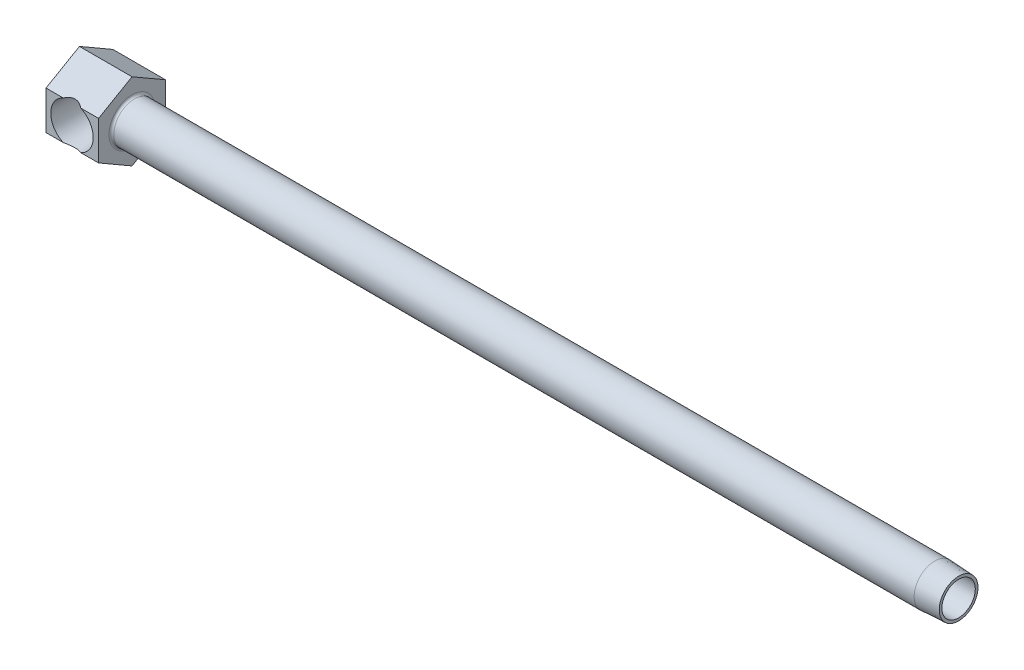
ISO-10303-21;
HEADER;
FILE_DESCRIPTION(('STEP AP214'),'2;1');
FILE_NAME('part.step','',(''),(''),'','','');
FILE_SCHEMA(('AUTOMOTIVE_DESIGN { 1 0 10303 214 1 1 1 1 }'));
ENDSEC;
DATA;
#1=APPLICATION_CONTEXT('core data for automotive mechanical design processes');
#2=APPLICATION_PROTOCOL_DEFINITION('international standard','automotive_design',2000,#1);
#3=PRODUCT_CONTEXT('',#1,'mechanical');
#4=PRODUCT('Part','Part','',(#3));
#5=PRODUCT_RELATED_PRODUCT_CATEGORY('part','',(#4));
#6=PRODUCT_DEFINITION_FORMATION('','',#4);
#7=PRODUCT_DEFINITION_CONTEXT('part definition',#1,'design');
#8=PRODUCT_DEFINITION('design','',#6,#7);
#9=PRODUCT_DEFINITION_SHAPE('','',#8);
#10=(LENGTH_UNIT() NAMED_UNIT(*) SI_UNIT(.MILLI.,.METRE.));
#11=(NAMED_UNIT(*) PLANE_ANGLE_UNIT() SI_UNIT($,.RADIAN.));
#12=(NAMED_UNIT(*) SI_UNIT($,.STERADIAN.) SOLID_ANGLE_UNIT());
#13=UNCERTAINTY_MEASURE_WITH_UNIT(LENGTH_MEASURE(1.E-05),#10,'distance_accuracy_value','');
#14=(GEOMETRIC_REPRESENTATION_CONTEXT(3) GLOBAL_UNCERTAINTY_ASSIGNED_CONTEXT((#13)) GLOBAL_UNIT_ASSIGNED_CONTEXT((#10,
#11,#12)) REPRESENTATION_CONTEXT('',''));
#15=CARTESIAN_POINT('',(0.,0.,0.));
#16=DIRECTION('',(0.,0.,1.));
#17=DIRECTION('',(1.,0.,0.));
#18=AXIS2_PLACEMENT_3D('',#15,#16,#17);
#19=CARTESIAN_POINT('',(63.5,0.,11.1125));
#20=DIRECTION('',(-1.,0.,0.));
#21=DIRECTION('',(0.,0.,1.));
#22=AXIS2_PLACEMENT_3D('',#19,#20,#21);
#23=CYLINDRICAL_SURFACE('',#22,6.858);
#24=CARTESIAN_POINT('',(18.2499,0.,11.1125));
#25=DIRECTION('',(-1.,0.,0.));
#26=DIRECTION('',(0.,-1.,0.));
#27=AXIS2_PLACEMENT_3D('',#24,#25,#26);
#28=CIRCLE('',#27,6.858);
#29=CARTESIAN_POINT('',(18.2499,-6.858,11.1125));
#30=VERTEX_POINT('',#29);
#31=EDGE_CURVE('E174',#30,#30,#28,.F.);
#32=ORIENTED_EDGE('',*,*,#31,.T.);
#33=EDGE_LOOP('',(#32));
#34=FACE_BOUND('',#33,.T.);
#35=CARTESIAN_POINT('',(284.1752,0.,11.1125));
#36=DIRECTION('',(1.,0.,0.));
#37=DIRECTION('',(0.,0.,-1.));
#38=AXIS2_PLACEMENT_3D('',#35,#36,#37);
#39=CIRCLE('',#38,6.858);
#40=CARTESIAN_POINT('',(284.1752,0.,4.2545));
#41=VERTEX_POINT('',#40);
#42=EDGE_CURVE('E218',#41,#41,#39,.T.);
#43=ORIENTED_EDGE('',*,*,#42,.F.);
#44=EDGE_LOOP('',(#43));
#45=FACE_BOUND('',#44,.T.);
#46=ADVANCED_FACE('F15',(#34,#45),#23,.T.);
#47=CARTESIAN_POINT('',(17.4625,6.4158048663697,22.225));
#48=DIRECTION('',(0.,0.,-1.));
#49=DIRECTION('',(0.,1.,0.));
#50=AXIS2_PLACEMENT_3D('',#47,#48,#49);
#51=PLANE('',#50);
#52=CARTESIAN_POINT('',(8.636,0.,22.225));
#53=DIRECTION('',(0.,0.,1.));
#54=DIRECTION('',(1.,0.,0.));
#55=AXIS2_PLACEMENT_3D('',#52,#53,#54);
#56=CIRCLE('',#55,7.05231);
#57=CARTESIAN_POINT('',(5.70811266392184,6.4158048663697,22.225));
#58=VERTEX_POINT('',#57);
#59=CARTESIAN_POINT('',(5.70811266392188,-6.41580486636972,22.225));
#60=VERTEX_POINT('',#59);
#61=EDGE_CURVE('E229',#58,#60,#56,.T.);
#62=ORIENTED_EDGE('',*,*,#61,.F.);
#63=DIRECTION('',(-1.,0.,0.));
#64=VECTOR('',#63,1.);
#65=CARTESIAN_POINT('',(17.4625,6.4158048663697,22.225));
#66=LINE('',#65,#64);
#67=CARTESIAN_POINT('',(0.,6.4158048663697,22.225));
#68=VERTEX_POINT('',#67);
#69=EDGE_CURVE('E158',#58,#68,#66,.T.);
#70=ORIENTED_EDGE('',*,*,#69,.T.);
#71=DIRECTION('',(0.,-1.,0.));
#72=VECTOR('',#71,1.);
#73=CARTESIAN_POINT('',(0.,6.4158048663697,22.225));
#74=LINE('',#73,#72);
#75=CARTESIAN_POINT('',(0.,-6.41580486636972,22.225));
#76=VERTEX_POINT('',#75);
#77=EDGE_CURVE('E128',#68,#76,#74,.T.);
#78=ORIENTED_EDGE('',*,*,#77,.T.);
#79=DIRECTION('',(-1.,0.,0.));
#80=VECTOR('',#79,1.);
#81=CARTESIAN_POINT('',(17.4625,-6.41580486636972,22.225));
#82=LINE('',#81,#80);
#83=EDGE_CURVE('E154',#60,#76,#82,.T.);
#84=ORIENTED_EDGE('',*,*,#83,.F.);
#85=EDGE_LOOP('',(#62,#70,#78,#84));
#86=FACE_BOUND('',#85,.T.);
#87=ADVANCED_FACE('F205',(#86),#51,.F.);
#88=CARTESIAN_POINT('',(11.5638873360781,-6.41580486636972,22.225));
#89=VERTEX_POINT('',#88);
#90=CARTESIAN_POINT('',(11.5638873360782,6.4158048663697,22.225));
#91=VERTEX_POINT('',#90);
#92=EDGE_CURVE('E228',#89,#91,#56,.T.);
#93=ORIENTED_EDGE('',*,*,#92,.F.);
#94=CARTESIAN_POINT('',(17.4625,-6.41580486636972,22.225));
#95=VERTEX_POINT('',#94);
#96=EDGE_CURVE('E155',#95,#89,#82,.T.);
#97=ORIENTED_EDGE('',*,*,#96,.F.);
#98=DIRECTION('',(0.,-1.,0.));
#99=VECTOR('',#98,1.);
#100=CARTESIAN_POINT('',(17.4625,6.4158048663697,22.225));
#101=LINE('',#100,#99);
#102=CARTESIAN_POINT('',(17.4625,6.4158048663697,22.225));
#103=VERTEX_POINT('',#102);
#104=EDGE_CURVE('E145',#103,#95,#101,.T.);
#105=ORIENTED_EDGE('',*,*,#104,.F.);
#106=EDGE_CURVE('E159',#103,#91,#66,.T.);
#107=ORIENTED_EDGE('',*,*,#106,.T.);
#108=EDGE_LOOP('',(#93,#97,#105,#107));
#109=FACE_BOUND('',#108,.T.);
#110=ADVANCED_FACE('F211',(#109),#51,.F.);
#111=CARTESIAN_POINT('',(17.4625,12.8316097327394,11.1125));
#112=DIRECTION('',(0.,-0.866025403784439,-0.5));
#113=DIRECTION('',(0.,0.5,-0.866025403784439));
#114=AXIS2_PLACEMENT_3D('',#111,#112,#113);
#115=PLANE('',#114);
#116=ORIENTED_EDGE('',*,*,#69,.F.);
#117=CARTESIAN_POINT('',(8.636,-0.384020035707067,34.002642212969));
#118=DIRECTION('',(0.,-0.866025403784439,-0.5));
#119=DIRECTION('',(0.,-0.5,0.866025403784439));
#120=AXIS2_PLACEMENT_3D('',#117,#118,#119);
#121=ELLIPSE('',#120,14.8098967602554,7.39498405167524);
#122=EDGE_CURVE('E109',#58,#91,#121,.T.);
#123=ORIENTED_EDGE('',*,*,#122,.T.);
#124=ORIENTED_EDGE('',*,*,#106,.F.);
#125=DIRECTION('',(0.,-0.5,0.866025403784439));
#126=VECTOR('',#125,1.);
#127=CARTESIAN_POINT('',(17.4625,12.8316097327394,11.1125));
#128=LINE('',#127,#126);
#129=CARTESIAN_POINT('',(17.4625,12.8316097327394,11.1125));
#130=VERTEX_POINT('',#129);
#131=EDGE_CURVE('E143',#130,#103,#128,.T.);
#132=ORIENTED_EDGE('',*,*,#131,.F.);
#133=DIRECTION('',(-1.,0.,0.));
#134=VECTOR('',#133,1.);
#135=CARTESIAN_POINT('',(17.4625,12.8316097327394,11.1125));
#136=LINE('',#135,#134);
#137=CARTESIAN_POINT('',(0.,12.8316097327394,11.1125));
#138=VERTEX_POINT('',#137);
#139=EDGE_CURVE('E162',#130,#138,#136,.T.);
#140=ORIENTED_EDGE('',*,*,#139,.T.);
#141=DIRECTION('',(0.,-0.5,0.866025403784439));
#142=VECTOR('',#141,1.);
#143=CARTESIAN_POINT('',(0.,12.8316097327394,11.1125));
#144=LINE('',#143,#142);
#145=EDGE_CURVE('E124',#138,#68,#144,.T.);
#146=ORIENTED_EDGE('',*,*,#145,.T.);
#147=EDGE_LOOP('',(#116,#123,#124,#132,#140,#146));
#148=FACE_BOUND('',#147,.T.);
#149=ADVANCED_FACE('F257',(#148),#115,.F.);
#150=CARTESIAN_POINT('',(17.4625,-6.41580486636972,22.225));
#151=DIRECTION('',(0.,0.866025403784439,-0.5));
#152=DIRECTION('',(0.,0.5,0.866025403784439));
#153=AXIS2_PLACEMENT_3D('',#150,#151,#152);
#154=PLANE('',#153);
#155=ORIENTED_EDGE('',*,*,#96,.T.);
#156=CARTESIAN_POINT('',(8.636,0.384020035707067,34.0026422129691));
#157=DIRECTION('',(0.,0.866025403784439,-0.5));
#158=DIRECTION('',(0.,0.5,0.866025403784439));
#159=AXIS2_PLACEMENT_3D('',#156,#157,#158);
#160=ELLIPSE('',#159,14.8098967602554,7.39498405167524);
#161=EDGE_CURVE('E34',#89,#60,#160,.T.);
#162=ORIENTED_EDGE('',*,*,#161,.T.);
#163=ORIENTED_EDGE('',*,*,#83,.T.);
#164=DIRECTION('',(0.,-0.5,-0.866025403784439));
#165=VECTOR('',#164,1.);
#166=CARTESIAN_POINT('',(0.,-6.41580486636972,22.225));
#167=LINE('',#166,#165);
#168=CARTESIAN_POINT('',(0.,-12.8316097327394,11.1125));
#169=VERTEX_POINT('',#168);
#170=EDGE_CURVE('E132',#76,#169,#167,.T.);
#171=ORIENTED_EDGE('',*,*,#170,.T.);
#172=DIRECTION('',(-1.,0.,0.));
#173=VECTOR('',#172,1.);
#174=CARTESIAN_POINT('',(17.4625,-12.8316097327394,11.1125));
#175=LINE('',#174,#173);
#176=CARTESIAN_POINT('',(17.4625,-12.8316097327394,11.1125));
#177=VERTEX_POINT('',#176);
#178=EDGE_CURVE('E149',#177,#169,#175,.T.);
#179=ORIENTED_EDGE('',*,*,#178,.F.);
#180=DIRECTION('',(0.,-0.5,-0.866025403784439));
#181=VECTOR('',#180,1.);
#182=CARTESIAN_POINT('',(17.4625,-6.41580486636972,22.225));
#183=LINE('',#182,#181);
#184=EDGE_CURVE('E147',#95,#177,#183,.T.);
#185=ORIENTED_EDGE('',*,*,#184,.F.);
#186=EDGE_LOOP('',(#155,#162,#163,#171,#179,#185));
#187=FACE_BOUND('',#186,.T.);
#188=ADVANCED_FACE('F235',(#187),#154,.F.);
#189=CARTESIAN_POINT('',(17.4625,-12.8316097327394,11.1125));
#190=DIRECTION('',(0.,0.866025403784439,0.5));
#191=DIRECTION('',(0.,-0.5,0.866025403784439));
#192=AXIS2_PLACEMENT_3D('',#189,#190,#191);
#193=PLANE('',#192);
#194=DIRECTION('',(0.,0.5,-0.866025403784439));
#195=VECTOR('',#194,1.);
#196=CARTESIAN_POINT('',(0.,-12.8316097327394,11.1125));
#197=LINE('',#196,#195);
#198=CARTESIAN_POINT('',(0.,-6.41580486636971,0.));
#199=VERTEX_POINT('',#198);
#200=EDGE_CURVE('E117',#169,#199,#197,.T.);
#201=ORIENTED_EDGE('',*,*,#200,.T.);
#202=DIRECTION('',(-1.,0.,0.));
#203=VECTOR('',#202,1.);
#204=CARTESIAN_POINT('',(17.4625,-6.41580486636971,0.));
#205=LINE('',#204,#203);
#206=CARTESIAN_POINT('',(17.4625,-6.41580486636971,0.));
#207=VERTEX_POINT('',#206);
#208=EDGE_CURVE('E168',#207,#199,#205,.T.);
#209=ORIENTED_EDGE('',*,*,#208,.F.);
#210=DIRECTION('',(0.,0.5,-0.866025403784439));
#211=VECTOR('',#210,1.);
#212=CARTESIAN_POINT('',(17.4625,-12.8316097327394,11.1125));
#213=LINE('',#212,#211);
#214=EDGE_CURVE('E135',#177,#207,#213,.T.);
#215=ORIENTED_EDGE('',*,*,#214,.F.);
#216=ORIENTED_EDGE('',*,*,#178,.T.);
#217=EDGE_LOOP('',(#201,#209,#215,#216));
#218=FACE_BOUND('',#217,.T.);
#219=ADVANCED_FACE('F247',(#218),#193,.F.);
#220=CARTESIAN_POINT('',(17.4625,-6.41580486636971,0.));
#221=DIRECTION('',(0.,0.,1.));
#222=DIRECTION('',(1.,0.,0.));
#223=AXIS2_PLACEMENT_3D('',#220,#221,#222);
#224=PLANE('',#223);
#225=DIRECTION('',(0.,1.,0.));
#226=VECTOR('',#225,1.);
#227=CARTESIAN_POINT('',(0.,-6.41580486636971,0.));
#228=LINE('',#227,#226);
#229=CARTESIAN_POINT('',(0.,6.41580486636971,0.));
#230=VERTEX_POINT('',#229);
#231=EDGE_CURVE('E118',#199,#230,#228,.T.);
#232=ORIENTED_EDGE('',*,*,#231,.T.);
#233=DIRECTION('',(-1.,0.,0.));
#234=VECTOR('',#233,1.);
#235=CARTESIAN_POINT('',(17.4625,6.41580486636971,0.));
#236=LINE('',#235,#234);
#237=CARTESIAN_POINT('',(17.4625,6.41580486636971,0.));
#238=VERTEX_POINT('',#237);
#239=EDGE_CURVE('E165',#238,#230,#236,.T.);
#240=ORIENTED_EDGE('',*,*,#239,.F.);
#241=DIRECTION('',(0.,1.,0.));
#242=VECTOR('',#241,1.);
#243=CARTESIAN_POINT('',(17.4625,-6.41580486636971,0.));
#244=LINE('',#243,#242);
#245=EDGE_CURVE('E139',#207,#238,#244,.T.);
#246=ORIENTED_EDGE('',*,*,#245,.F.);
#247=ORIENTED_EDGE('',*,*,#208,.T.);
#248=EDGE_LOOP('',(#232,#240,#246,#247));
#249=FACE_BOUND('',#248,.T.);
#250=ADVANCED_FACE('F264',(#249),#224,.F.);
#251=CARTESIAN_POINT('',(17.4625,6.4158048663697,0.));
#252=DIRECTION('',(0.,-0.866025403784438,0.5));
#253=DIRECTION('',(0.,-0.5,-0.866025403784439));
#254=AXIS2_PLACEMENT_3D('',#251,#252,#253);
#255=PLANE('',#254);
#256=DIRECTION('',(0.,0.5,0.866025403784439));
#257=VECTOR('',#256,1.);
#258=CARTESIAN_POINT('',(0.,6.4158048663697,0.));
#259=LINE('',#258,#257);
#260=EDGE_CURVE('E121',#230,#138,#259,.T.);
#261=ORIENTED_EDGE('',*,*,#260,.T.);
#262=ORIENTED_EDGE('',*,*,#139,.F.);
#263=DIRECTION('',(0.,0.5,0.866025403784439));
#264=VECTOR('',#263,1.);
#265=CARTESIAN_POINT('',(17.4625,6.4158048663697,0.));
#266=LINE('',#265,#264);
#267=EDGE_CURVE('E141',#238,#130,#266,.T.);
#268=ORIENTED_EDGE('',*,*,#267,.F.);
#269=ORIENTED_EDGE('',*,*,#239,.T.);
#270=EDGE_LOOP('',(#261,#262,#268,#269));
#271=FACE_BOUND('',#270,.T.);
#272=ADVANCED_FACE('F261',(#271),#255,.F.);
#273=CARTESIAN_POINT('',(17.4625,-19.2474145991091,22.225));
#274=DIRECTION('',(-1.,0.,0.));
#275=DIRECTION('',(0.,-1.,0.));
#276=AXIS2_PLACEMENT_3D('',#273,#274,#275);
#277=PLANE('',#276);
#278=CARTESIAN_POINT('',(17.4625,0.,11.1125));
#279=DIRECTION('',(-1.,0.,0.));
#280=DIRECTION('',(0.,-1.,0.));
#281=AXIS2_PLACEMENT_3D('',#278,#279,#280);
#282=CIRCLE('',#281,7.6454);
#283=CARTESIAN_POINT('',(17.4625,-7.6454,11.1125));
#284=VERTEX_POINT('',#283);
#285=EDGE_CURVE('E171',#284,#284,#282,.T.);
#286=ORIENTED_EDGE('',*,*,#285,.T.);
#287=EDGE_LOOP('',(#286));
#288=FACE_BOUND('',#287,.T.);
#289=ORIENTED_EDGE('',*,*,#214,.T.);
#290=ORIENTED_EDGE('',*,*,#245,.T.);
#291=ORIENTED_EDGE('',*,*,#267,.T.);
#292=ORIENTED_EDGE('',*,*,#131,.T.);
#293=ORIENTED_EDGE('',*,*,#104,.T.);
#294=ORIENTED_EDGE('',*,*,#184,.T.);
#295=EDGE_LOOP('',(#289,#290,#291,#292,#293,#294));
#296=FACE_BOUND('',#295,.T.);
#297=ADVANCED_FACE('F250',(#288,#296),#277,.F.);
#298=CARTESIAN_POINT('',(0.,-19.2474145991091,22.225));
#299=DIRECTION('',(-1.,0.,0.));
#300=DIRECTION('',(0.,-1.,0.));
#301=AXIS2_PLACEMENT_3D('',#298,#299,#300);
#302=PLANE('',#301);
#303=ORIENTED_EDGE('',*,*,#200,.F.);
#304=ORIENTED_EDGE('',*,*,#170,.F.);
#305=ORIENTED_EDGE('',*,*,#77,.F.);
#306=ORIENTED_EDGE('',*,*,#145,.F.);
#307=ORIENTED_EDGE('',*,*,#260,.F.);
#308=ORIENTED_EDGE('',*,*,#231,.F.);
#309=EDGE_LOOP('',(#303,#304,#305,#306,#307,#308));
#310=FACE_BOUND('',#309,.T.);
#311=ADVANCED_FACE('F243',(#310),#302,.T.);
#312=CARTESIAN_POINT('',(18.2499,0.,11.1125));
#313=DIRECTION('',(-1.,0.,0.));
#314=DIRECTION('',(0.,-1.,0.));
#315=AXIS2_PLACEMENT_3D('',#312,#313,#314);
#316=TOROIDAL_SURFACE('',#315,7.6454,0.7874);
#317=ORIENTED_EDGE('',*,*,#31,.F.);
#318=EDGE_LOOP('',(#317));
#319=FACE_BOUND('',#318,.T.);
#320=ORIENTED_EDGE('',*,*,#285,.F.);
#321=EDGE_LOOP('',(#320));
#322=FACE_BOUND('',#321,.T.);
#323=ADVANCED_FACE('F282',(#319,#322),#316,.F.);
#324=CARTESIAN_POINT('',(63.5,0.,11.1125));
#325=DIRECTION('',(1.,0.,0.));
#326=DIRECTION('',(0.,0.,-1.));
#327=AXIS2_PLACEMENT_3D('',#324,#325,#326);
#328=CYLINDRICAL_SURFACE('',#327,5.5499);
#329=DIRECTION('',(1.,0.,0.));
#330=VECTOR('',#329,1.);
#331=CARTESIAN_POINT('',(63.5,1.29165930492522,5.715));
#332=LINE('',#331,#330);
#333=CARTESIAN_POINT('',(15.0655177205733,1.29165930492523,5.715));
#334=VERTEX_POINT('',#333);
#335=CARTESIAN_POINT('',(14.0465577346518,1.29165930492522,5.715));
#336=VERTEX_POINT('',#335);
#337=EDGE_CURVE('E27',#334,#336,#332,.F.);
#338=ORIENTED_EDGE('',*,*,#337,.T.);
#339=CARTESIAN_POINT('',(14.0465577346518,1.29165930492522,5.715));
#340=CARTESIAN_POINT('',(14.0725617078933,1.1828202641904,5.68893317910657));
#341=CARTESIAN_POINT('',(14.0954190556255,1.0724477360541,5.66602138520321));
#342=CARTESIAN_POINT('',(14.1345363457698,0.849345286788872,5.62681178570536));
#343=CARTESIAN_POINT('',(14.1507939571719,0.736614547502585,5.61051631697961));
#344=CARTESIAN_POINT('',(14.1760383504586,0.512691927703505,5.58521342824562));
#345=CARTESIAN_POINT('',(14.1852120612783,0.401542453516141,5.57601863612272));
#346=CARTESIAN_POINT('',(14.1968530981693,0.17856718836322,5.56435088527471));
#347=CARTESIAN_POINT('',(14.1993222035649,0.0667415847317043,5.56187614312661));
#348=CARTESIAN_POINT('',(14.1975723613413,-0.14949882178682,5.56362999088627));
#349=CARTESIAN_POINT('',(14.193779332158,-0.253921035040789,5.56743168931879));
#350=CARTESIAN_POINT('',(14.1803598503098,-0.462026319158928,5.58088200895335));
#351=CARTESIAN_POINT('',(14.1707325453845,-0.565709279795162,5.59053148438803));
#352=CARTESIAN_POINT('',(14.1454600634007,-0.774399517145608,5.61586264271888));
#353=CARTESIAN_POINT('',(14.12966315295,-0.87936981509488,5.63169642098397));
#354=CARTESIAN_POINT('',(14.092340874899,-1.08722287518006,5.6691068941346));
#355=CARTESIAN_POINT('',(14.0708169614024,-1.1901061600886,5.69068213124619));
#356=CARTESIAN_POINT('',(14.0465577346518,-1.29165930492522,5.715));
#357=B_SPLINE_CURVE_WITH_KNOTS('',3,(#339,#340,#341,#342,#343,#344,#345,#346,#347,#348,#349,
#350,#351,#352,#353,#354,#355,#356),.UNSPECIFIED.,.F.,.F.,(4,2,2,2,2,2,2,2,4),(0.,
0.344637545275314,0.689396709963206,1.02471413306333,1.35994255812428,1.67329546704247,
1.98669416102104,2.30834220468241,2.62990865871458),.UNSPECIFIED.);
#358=CARTESIAN_POINT('',(14.0465577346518,-1.29165930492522,5.715));
#359=VERTEX_POINT('',#358);
#360=EDGE_CURVE('E10',#336,#359,#357,.T.);
#361=ORIENTED_EDGE('',*,*,#360,.T.);
#362=DIRECTION('',(1.,0.,0.));
#363=VECTOR('',#362,1.);
#364=CARTESIAN_POINT('',(63.5,-1.29165930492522,5.715));
#365=LINE('',#364,#363);
#366=CARTESIAN_POINT('',(15.0655177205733,-1.29165930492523,5.715));
#367=VERTEX_POINT('',#366);
#368=EDGE_CURVE('E184',#359,#367,#365,.T.);
#369=ORIENTED_EDGE('',*,*,#368,.T.);
#370=CARTESIAN_POINT('',(15.0656795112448,-1.29082327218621,5.71480000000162));
#371=CARTESIAN_POINT('',(15.0372536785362,-1.43791824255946,5.7499521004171));
#372=CARTESIAN_POINT('',(15.0041876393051,-1.58262926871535,5.79093746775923));
#373=CARTESIAN_POINT('',(14.9298152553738,-1.86616189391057,5.88364074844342));
#374=CARTESIAN_POINT('',(14.8885204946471,-2.00499144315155,5.93534357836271));
#375=CARTESIAN_POINT('',(14.7990709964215,-2.27477346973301,6.0481148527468));
#376=CARTESIAN_POINT('',(14.7509848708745,-2.40578805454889,6.10909004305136));
#377=CARTESIAN_POINT('',(14.6486806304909,-2.66083130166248,6.2399326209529));
#378=CARTESIAN_POINT('',(14.5944604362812,-2.78485757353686,6.30980302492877));
#379=CARTESIAN_POINT('',(14.4812536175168,-3.02482355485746,6.4572285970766));
#380=CARTESIAN_POINT('',(14.4222960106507,-3.1408054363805,6.53473755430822));
#381=CARTESIAN_POINT('',(14.3003856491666,-3.365215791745,6.6970845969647));
#382=CARTESIAN_POINT('',(14.2374332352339,-3.47364490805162,6.78192205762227));
#383=CARTESIAN_POINT('',(14.0435453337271,-3.78827180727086,7.04729631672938));
#384=CARTESIAN_POINT('',(13.9079456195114,-3.9830565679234,7.23822682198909));
#385=CARTESIAN_POINT('',(13.689310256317,-4.26816238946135,7.56146618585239));
#386=CARTESIAN_POINT('',(13.6074310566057,-4.3686517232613,7.68585924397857));
#387=CARTESIAN_POINT('',(13.4442899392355,-4.55879004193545,7.94320688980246));
#388=CARTESIAN_POINT('',(13.3630282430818,-4.6484352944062,8.07616440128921));
#389=CARTESIAN_POINT('',(13.2036424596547,-4.81645966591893,8.35044586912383));
#390=CARTESIAN_POINT('',(13.1255135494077,-4.89485662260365,8.49175606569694));
#391=CARTESIAN_POINT('',(12.9752684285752,-5.04004510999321,8.78316437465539));
#392=CARTESIAN_POINT('',(12.9031480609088,-5.10684469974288,8.93325628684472));
#393=CARTESIAN_POINT('',(12.757824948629,-5.23785122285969,9.26762207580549));
#394=CARTESIAN_POINT('',(12.686320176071,-5.29990617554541,9.45350692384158));
#395=CARTESIAN_POINT('',(12.5645322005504,-5.40502712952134,9.83721903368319));
#396=CARTESIAN_POINT('',(12.5142004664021,-5.44813656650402,10.035017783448));
#397=CARTESIAN_POINT('',(12.4606756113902,-5.49679755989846,10.3395644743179));
#398=CARTESIAN_POINT('',(12.4464754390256,-5.51038902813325,10.443158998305));
#399=CARTESIAN_POINT('',(12.4264834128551,-5.5317354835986,10.6517762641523));
#400=CARTESIAN_POINT('',(12.4206908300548,-5.53949097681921,10.7567988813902));
#401=CARTESIAN_POINT('',(12.4179376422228,-5.54899639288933,10.9671942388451));
#402=CARTESIAN_POINT('',(12.4209736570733,-5.55074861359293,11.0725668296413));
#403=CARTESIAN_POINT('',(12.4357182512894,-5.54828805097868,11.2826067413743));
#404=CARTESIAN_POINT('',(12.4474268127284,-5.54407527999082,11.3872740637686));
#405=CARTESIAN_POINT('',(12.4900727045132,-5.52483789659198,11.6684350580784));
#406=CARTESIAN_POINT('',(12.5287513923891,-5.5042766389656,11.8434168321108));
#407=CARTESIAN_POINT('',(12.6245766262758,-5.44793106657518,12.1856637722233));
#408=CARTESIAN_POINT('',(12.6817493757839,-5.41212512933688,12.3529176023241));
#409=CARTESIAN_POINT('',(12.8020710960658,-5.33165221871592,12.6608364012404));
#410=CARTESIAN_POINT('',(12.8638814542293,-5.28838367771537,12.8024081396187));
#411=CARTESIAN_POINT('',(12.9946271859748,-5.19196308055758,13.0788046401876));
#412=CARTESIAN_POINT('',(13.0635675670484,-5.13880405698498,13.2136245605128));
#413=CARTESIAN_POINT('',(13.2061680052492,-5.0230773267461,13.476991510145));
#414=CARTESIAN_POINT('',(13.2798387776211,-4.96048779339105,13.6055230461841));
#415=CARTESIAN_POINT('',(13.4297455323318,-4.82635797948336,13.8561944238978));
#416=CARTESIAN_POINT('',(13.505980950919,-4.75481965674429,13.9783356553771));
#417=CARTESIAN_POINT('',(13.664111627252,-4.59832635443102,14.2236446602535));
#418=CARTESIAN_POINT('',(13.7460684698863,-4.51281916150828,14.3464205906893));
#419=CARTESIAN_POINT('',(13.9094765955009,-4.33199713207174,14.5849036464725));
#420=CARTESIAN_POINT('',(13.9909278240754,-4.23668125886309,14.7006100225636));
#421=CARTESIAN_POINT('',(14.1517819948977,-4.03638256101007,14.9245234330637));
#422=CARTESIAN_POINT('',(14.231187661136,-3.93141354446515,15.0327408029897));
#423=CARTESIAN_POINT('',(14.3867175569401,-3.71172769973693,15.2413555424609));
#424=CARTESIAN_POINT('',(14.4628409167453,-3.59700831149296,15.3417508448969));
#425=CARTESIAN_POINT('',(14.668135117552,-3.26437402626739,15.6091426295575));
#426=CARTESIAN_POINT('',(14.7924014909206,-3.03572507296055,15.7670513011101));
#427=CARTESIAN_POINT('',(14.961823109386,-2.67104021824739,15.9794040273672));
#428=CARTESIAN_POINT('',(15.0154673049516,-2.54586009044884,16.0461031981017));
#429=CARTESIAN_POINT('',(15.1161712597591,-2.28856209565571,16.1705894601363));
#430=CARTESIAN_POINT('',(15.1632322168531,-2.15644549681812,16.2283781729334));
#431=CARTESIAN_POINT('',(15.2428146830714,-1.9076542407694,16.3256678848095));
#432=CARTESIAN_POINT('',(15.2764575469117,-1.79190088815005,16.3666154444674));
#433=CARTESIAN_POINT('',(15.3378292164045,-1.55651069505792,16.4410921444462));
#434=CARTESIAN_POINT('',(15.3655591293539,-1.43687458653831,16.4746226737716));
#435=CARTESIAN_POINT('',(15.4145953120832,-1.19439983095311,16.5337884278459));
#436=CARTESIAN_POINT('',(15.4359031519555,-1.0715619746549,16.5594255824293));
#437=CARTESIAN_POINT('',(15.4716760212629,-0.823504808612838,16.6024058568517));
#438=CARTESIAN_POINT('',(15.4861437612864,-0.698286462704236,16.6197522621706));
#439=CARTESIAN_POINT('',(15.5079865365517,-0.445852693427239,16.645922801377));
#440=CARTESIAN_POINT('',(15.5153340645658,-0.318631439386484,16.6547138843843));
#441=CARTESIAN_POINT('',(15.522677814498,-0.063671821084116,16.6635004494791));
#442=CARTESIAN_POINT('',(15.5226740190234,0.0640665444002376,16.6634959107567));
#443=CARTESIAN_POINT('',(15.5153149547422,0.319031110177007,16.6546910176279));
#444=CARTESIAN_POINT('',(15.5079593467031,0.446257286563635,16.64589025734));
#445=CARTESIAN_POINT('',(15.4860583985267,0.699182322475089,16.6196499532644));
#446=CARTESIAN_POINT('',(15.4715132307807,0.824881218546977,16.6022106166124));
#447=CARTESIAN_POINT('',(15.4365532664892,1.06681669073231,16.5602063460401));
#448=CARTESIAN_POINT('',(15.4165150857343,1.18318753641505,16.5360979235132));
#449=CARTESIAN_POINT('',(15.370668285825,1.41308832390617,16.4807930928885));
#450=CARTESIAN_POINT('',(15.3448577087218,1.52661728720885,16.4495942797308));
#451=CARTESIAN_POINT('',(15.2593968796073,1.8619852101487,16.3459550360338));
#452=CARTESIAN_POINT('',(15.1916934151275,2.07876635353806,16.2634431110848));
#453=CARTESIAN_POINT('',(15.0313088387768,2.51543897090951,16.0659794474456));
#454=CARTESIAN_POINT('',(14.9368359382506,2.73357267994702,15.9486491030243));
#455=CARTESIAN_POINT('',(14.7321201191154,3.14711164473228,15.6903358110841));
#456=CARTESIAN_POINT('',(14.6218705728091,3.34250728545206,15.549342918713));
#457=CARTESIAN_POINT('',(14.3660176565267,3.74896640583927,15.2149275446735));
#458=CARTESIAN_POINT('',(14.217881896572,3.95452519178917,15.0167316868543));
#459=CARTESIAN_POINT('',(13.9905991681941,4.23685264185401,14.7000501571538));
#460=CARTESIAN_POINT('',(13.9138995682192,4.32671599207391,14.5911203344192));
#461=CARTESIAN_POINT('',(13.7600052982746,4.49774000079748,14.366972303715));
#462=CARTESIAN_POINT('',(13.682810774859,4.57890311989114,14.2517558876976));
#463=CARTESIAN_POINT('',(13.5283146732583,4.73340315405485,14.0136509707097));
#464=CARTESIAN_POINT('',(13.4510233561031,4.80663208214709,13.8906858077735));
#465=CARTESIAN_POINT('',(13.2989020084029,4.94395744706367,13.6382338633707));
#466=CARTESIAN_POINT('',(13.2240725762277,5.00805167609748,13.5087455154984));
#467=CARTESIAN_POINT('',(13.0790371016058,5.12664196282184,13.2432341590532));
#468=CARTESIAN_POINT('',(13.0088235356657,5.18115389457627,13.107222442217));
#469=CARTESIAN_POINT('',(12.8755190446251,5.28008101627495,12.8283198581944));
#470=CARTESIAN_POINT('',(12.8124234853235,5.3245027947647,12.6854335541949));
#471=CARTESIAN_POINT('',(12.6833891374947,5.4112685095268,12.3591277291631));
#472=CARTESIAN_POINT('',(12.6200540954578,5.45085356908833,12.1738679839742));
#473=CARTESIAN_POINT('',(12.5423523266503,5.49611259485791,11.8892630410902));
#474=CARTESIAN_POINT('',(12.5193453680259,5.50884182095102,11.7933456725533));
#475=CARTESIAN_POINT('',(12.4799604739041,5.52933440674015,11.5996550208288));
#476=CARTESIAN_POINT('',(12.4635791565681,5.53710030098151,11.5018827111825));
#477=CARTESIAN_POINT('',(12.4380468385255,5.54748556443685,11.3040796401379));
#478=CARTESIAN_POINT('',(12.4289726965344,5.55005064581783,11.2040359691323));
#479=CARTESIAN_POINT('',(12.418786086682,5.54973569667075,11.0035516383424));
#480=CARTESIAN_POINT('',(12.4176731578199,5.54685598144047,10.9031110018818));
#481=CARTESIAN_POINT('',(12.4234254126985,5.53566138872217,10.7027211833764));
#482=CARTESIAN_POINT('',(12.4302942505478,5.52734402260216,10.6027722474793));
#483=CARTESIAN_POINT('',(12.4515981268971,5.5054275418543,10.4042328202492));
#484=CARTESIAN_POINT('',(12.4660373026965,5.4918255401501,10.3056431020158));
#485=CARTESIAN_POINT('',(12.5044721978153,5.45712893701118,10.0955734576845));
#486=CARTESIAN_POINT('',(12.5295946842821,5.43520467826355,9.98443807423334));
#487=CARTESIAN_POINT('',(12.5874763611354,5.38514310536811,9.76556012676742));
#488=CARTESIAN_POINT('',(12.6202414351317,5.35700100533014,9.65782024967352));
#489=CARTESIAN_POINT('',(12.6919869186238,5.29489520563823,9.44585515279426));
#490=CARTESIAN_POINT('',(12.7309829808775,5.2609168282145,9.34163960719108));
#491=CARTESIAN_POINT('',(12.813732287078,5.18758941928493,9.13712531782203));
#492=CARTESIAN_POINT('',(12.8574843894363,5.14824167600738,9.03682564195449));
#493=CARTESIAN_POINT('',(12.9739768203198,5.04107082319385,8.78510193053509));
#494=CARTESIAN_POINT('',(13.0492646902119,4.96961386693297,8.63639571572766));
#495=CARTESIAN_POINT('',(13.2048344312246,4.81508369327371,8.34787401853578));
#496=CARTESIAN_POINT('',(13.2851189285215,4.73200433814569,8.20806329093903));
#497=CARTESIAN_POINT('',(13.4480056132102,4.55446924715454,7.93688996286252));
#498=CARTESIAN_POINT('',(13.5306114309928,4.45999483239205,7.80554179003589));
#499=CARTESIAN_POINT('',(13.6957298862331,4.25996324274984,7.55156980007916));
#500=CARTESIAN_POINT('',(13.7782425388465,4.15440825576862,7.42894426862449));
#501=CARTESIAN_POINT('',(13.9441031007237,3.92836612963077,7.18853642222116));
#502=CARTESIAN_POINT('',(14.0273794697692,3.80748613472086,7.0710730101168));
#503=CARTESIAN_POINT('',(14.1898135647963,3.55392137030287,6.84638586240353));
#504=CARTESIAN_POINT('',(14.2689704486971,3.42123420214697,6.73916421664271));
#505=CARTESIAN_POINT('',(14.420885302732,3.14485348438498,6.53641941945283));
#506=CARTESIAN_POINT('',(14.4936705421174,3.0012123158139,6.44084565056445));
#507=CARTESIAN_POINT('',(14.6312840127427,2.70291662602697,6.2621549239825));
#508=CARTESIAN_POINT('',(14.6961173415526,2.54826926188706,6.17902997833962));
#509=CARTESIAN_POINT('',(14.8204425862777,2.21665612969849,6.02094073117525));
#510=CARTESIAN_POINT('',(14.8791782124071,2.03888590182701,5.94704372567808));
#511=CARTESIAN_POINT('',(14.957111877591,1.76426185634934,5.84958505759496));
#512=CARTESIAN_POINT('',(14.9814347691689,1.67119024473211,5.81928093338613));
#513=CARTESIAN_POINT('',(15.0263924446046,1.48269404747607,5.76341790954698));
#514=CARTESIAN_POINT('',(15.047024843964,1.38726798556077,5.73786207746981));
#515=CARTESIAN_POINT('',(15.0656795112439,1.2908232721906,5.71480000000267));
#516=B_SPLINE_CURVE_WITH_KNOTS('',3,(#370,#371,#372,#373,#374,#375,#376,#377,#378,#379,#380,
#381,#382,#383,#384,#385,#386,#387,#388,#389,#390,#391,#392,#393,#394,#395,#396,#397,#398,#399,
#400,#401,#402,#403,#404,#405,#406,#407,#408,#409,#410,#411,#412,#413,#414,#415,#416,#417,#418,
#419,#420,#421,#422,#423,#424,#425,#426,#427,#428,#429,#430,#431,#432,#433,#434,#435,#436,#437,
#438,#439,#440,#441,#442,#443,#444,#445,#446,#447,#448,#449,#450,#451,#452,#453,#454,#455,#456,
#457,#458,#459,#460,#461,#462,#463,#464,#465,#466,#467,#468,#469,#470,#471,#472,#473,#474,#475,
#476,#477,#478,#479,#480,#481,#482,#483,#484,#485,#486,#487,#488,#489,#490,#491,#492,#493,#494,
#495,#496,#497,#498,#499,#500,#501,#502,#503,#504,#505,#506,#507,#508,#509,#510,#511,#512,#513,
#514,#515),.UNSPECIFIED.,.F.,.F.,(4,2,2,2,2,2,2,2,2,2,2,2,2,2,2,2,2,2,2,2,2,2,2,2,2,2,2,2,2,2,2,
2,2,2,2,2,2,2,2,2,2,2,2,2,2,2,2,2,2,2,2,2,2,2,2,2,2,2,2,2,2,2,2,2,2,2,2,2,2,2,2,2,4),(0.,
0.461329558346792,0.922014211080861,1.37833951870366,1.83481998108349,2.2886910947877,
2.74252355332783,3.65304009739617,4.19159436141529,4.73033346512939,5.26820855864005,
5.80570837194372,6.42981366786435,7.05248053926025,7.36837231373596,7.68423669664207,
7.99998016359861,8.31572297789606,8.85459341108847,9.39423071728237,9.87481564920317,
10.3557404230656,10.837795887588,11.3197460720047,11.8310943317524,12.3424966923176,
12.8531785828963,13.3639949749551,14.2729996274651,14.7275015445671,15.1819206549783,
15.5634665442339,15.9449409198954,16.3263219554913,16.707551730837,17.0902484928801,
17.472946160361,17.8556614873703,18.2383676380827,18.5995247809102,18.9608046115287,
19.682873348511,20.4753483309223,21.2681572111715,22.2295647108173,22.7113905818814,
23.1930798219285,23.6806666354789,24.1683710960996,24.6552598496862,25.1418297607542,
25.7388115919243,26.0368814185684,26.3347989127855,26.6358104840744,26.9368046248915,
27.237936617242,27.5392333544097,27.8867825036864,28.2346001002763,28.5833055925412,
28.9319275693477,29.4751694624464,30.0186993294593,30.5631325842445,31.1074585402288,
31.6708023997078,32.2342609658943,32.7951763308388,33.3557302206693,33.9579898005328,
34.2603814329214,34.5629677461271),.UNSPECIFIED.);
#517=EDGE_CURVE('E177',#367,#334,#516,.T.);
#518=ORIENTED_EDGE('',*,*,#517,.T.);
#519=EDGE_LOOP('',(#338,#361,#369,#518));
#520=FACE_BOUND('',#519,.T.);
#521=CARTESIAN_POINT('',(292.1,0.,11.1125));
#522=DIRECTION('',(1.,0.,0.));
#523=DIRECTION('',(0.,0.,-1.));
#524=AXIS2_PLACEMENT_3D('',#521,#522,#523);
#525=CIRCLE('',#524,5.5499);
#526=CARTESIAN_POINT('',(292.1,0.,5.5626));
#527=VERTEX_POINT('',#526);
#528=EDGE_CURVE('E223',#527,#527,#525,.T.);
#529=ORIENTED_EDGE('',*,*,#528,.T.);
#530=EDGE_LOOP('',(#529));
#531=FACE_BOUND('',#530,.T.);
#532=ADVANCED_FACE('F185',(#520,#531),#328,.F.);
#533=CARTESIAN_POINT('',(14.1986,0.,5.715));
#534=DIRECTION('',(0.,0.,-1.));
#535=DIRECTION('',(-1.,0.,0.));
#536=AXIS2_PLACEMENT_3D('',#533,#534,#535);
#537=PLANE('',#536);
#538=CARTESIAN_POINT('',(8.636,0.,5.715));
#539=DIRECTION('',(0.,0.,1.));
#540=DIRECTION('',(1.,0.,0.));
#541=AXIS2_PLACEMENT_3D('',#538,#539,#540);
#542=CIRCLE('',#541,6.55797849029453);
#543=EDGE_CURVE('E41',#334,#367,#542,.T.);
#544=ORIENTED_EDGE('',*,*,#543,.T.);
#545=ORIENTED_EDGE('',*,*,#368,.F.);
#546=CARTESIAN_POINT('',(8.636,0.,5.715));
#547=DIRECTION('',(0.,0.,1.));
#548=DIRECTION('',(1.,0.,0.));
#549=AXIS2_PLACEMENT_3D('',#546,#547,#548);
#550=CIRCLE('',#549,5.5626);
#551=EDGE_CURVE('E107',#336,#359,#550,.T.);
#552=ORIENTED_EDGE('',*,*,#551,.F.);
#553=ORIENTED_EDGE('',*,*,#337,.F.);
#554=EDGE_LOOP('',(#544,#545,#552,#553));
#555=FACE_BOUND('',#554,.T.);
#556=ADVANCED_FACE('F194',(#555),#537,.F.);
#557=CARTESIAN_POINT('',(8.636,0.,22.225));
#558=DIRECTION('',(0.,0.,1.));
#559=DIRECTION('',(1.,0.,0.));
#560=AXIS2_PLACEMENT_3D('',#557,#558,#559);
#561=CYLINDRICAL_SURFACE('',#560,5.5626);
#562=CARTESIAN_POINT('',(8.636,0.,4.445));
#563=DIRECTION('',(0.,0.,1.));
#564=DIRECTION('',(1.,0.,0.));
#565=AXIS2_PLACEMENT_3D('',#562,#563,#564);
#566=CIRCLE('',#565,5.5626);
#567=CARTESIAN_POINT('',(14.1986,0.,4.445));
#568=VERTEX_POINT('',#567);
#569=EDGE_CURVE('E105',#568,#568,#566,.T.);
#570=ORIENTED_EDGE('',*,*,#569,.F.);
#571=EDGE_LOOP('',(#570));
#572=FACE_BOUND('',#571,.T.);
#573=ORIENTED_EDGE('',*,*,#551,.T.);
#574=ORIENTED_EDGE('',*,*,#360,.F.);
#575=EDGE_LOOP('',(#573,#574));
#576=FACE_BOUND('',#575,.T.);
#577=ADVANCED_FACE('F192',(#572,#576),#561,.F.);
#578=CARTESIAN_POINT('',(8.636,0.,22.225));
#579=DIRECTION('',(0.,0.,1.));
#580=DIRECTION('',(1.,0.,0.));
#581=AXIS2_PLACEMENT_3D('',#578,#579,#580);
#582=CONICAL_SURFACE('',#581,7.05231,0.0299323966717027);
#583=ORIENTED_EDGE('',*,*,#543,.F.);
#584=ORIENTED_EDGE('',*,*,#517,.F.);
#585=EDGE_LOOP('',(#583,#584));
#586=FACE_BOUND('',#585,.T.);
#587=ORIENTED_EDGE('',*,*,#61,.T.);
#588=ORIENTED_EDGE('',*,*,#161,.F.);
#589=ORIENTED_EDGE('',*,*,#92,.T.);
#590=ORIENTED_EDGE('',*,*,#122,.F.);
#591=EDGE_LOOP('',(#587,#588,#589,#590));
#592=FACE_BOUND('',#591,.T.);
#593=ADVANCED_FACE('F101',(#586,#592),#582,.F.);
#594=CARTESIAN_POINT('',(8.636,0.,4.445));
#595=DIRECTION('',(0.,0.,1.));
#596=DIRECTION('',(1.,0.,0.));
#597=AXIS2_PLACEMENT_3D('',#594,#595,#596);
#598=CONICAL_SURFACE('',#597,5.5626,1.02974425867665);
#599=CARTESIAN_POINT('',(8.636,0.,1.10265272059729));
#600=VERTEX_POINT('',#599);
#601=VERTEX_LOOP('',#600);
#602=FACE_BOUND('',#601,.T.);
#603=ORIENTED_EDGE('',*,*,#569,.T.);
#604=EDGE_LOOP('',(#603));
#605=FACE_BOUND('',#604,.T.);
#606=ADVANCED_FACE('F97',(#602,#605),#598,.F.);
#607=CARTESIAN_POINT('',(292.1,0.,5.5626));
#608=DIRECTION('',(1.,0.,0.));
#609=DIRECTION('',(0.,0.,-1.));
#610=AXIS2_PLACEMENT_3D('',#607,#608,#609);
#611=PLANE('',#610);
#612=CARTESIAN_POINT('',(292.1,0.,11.1125));
#613=DIRECTION('',(1.,0.,0.));
#614=DIRECTION('',(0.,0.,-1.));
#615=AXIS2_PLACEMENT_3D('',#612,#613,#614);
#616=CIRCLE('',#615,6.44267883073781);
#617=CARTESIAN_POINT('',(292.1,0.,4.66982116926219));
#618=VERTEX_POINT('',#617);
#619=EDGE_CURVE('E220',#618,#618,#616,.T.);
#620=ORIENTED_EDGE('',*,*,#619,.T.);
#621=EDGE_LOOP('',(#620));
#622=FACE_BOUND('',#621,.T.);
#623=ORIENTED_EDGE('',*,*,#528,.F.);
#624=EDGE_LOOP('',(#623));
#625=FACE_BOUND('',#624,.T.);
#626=ADVANCED_FACE('F100',(#622,#625),#611,.T.);
#627=CARTESIAN_POINT('',(292.1,0.,11.1125));
#628=DIRECTION('',(-1.,0.,0.));
#629=DIRECTION('',(0.,0.,1.));
#630=AXIS2_PLACEMENT_3D('',#627,#628,#629);
#631=CONICAL_SURFACE('',#630,6.44267883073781,0.052359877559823);
#632=ORIENTED_EDGE('',*,*,#42,.T.);
#633=EDGE_LOOP('',(#632));
#634=FACE_BOUND('',#633,.T.);
#635=ORIENTED_EDGE('',*,*,#619,.F.);
#636=EDGE_LOOP('',(#635));
#637=FACE_BOUND('',#636,.T.);
#638=ADVANCED_FACE('F300',(#634,#637),#631,.T.);
#639=CLOSED_SHELL('',(#46,#87,#110,#149,#188,#219,#250,#272,#297,#311,#323,#532,#556,#577,#593,
#606,#626,#638));
#640=MANIFOLD_SOLID_BREP('B1',#639);
#641=ADVANCED_BREP_SHAPE_REPRESENTATION('',(#18,#640),#14);
#642=SHAPE_DEFINITION_REPRESENTATION(#9,#641);
ENDSEC;
END-ISO-10303-21;
